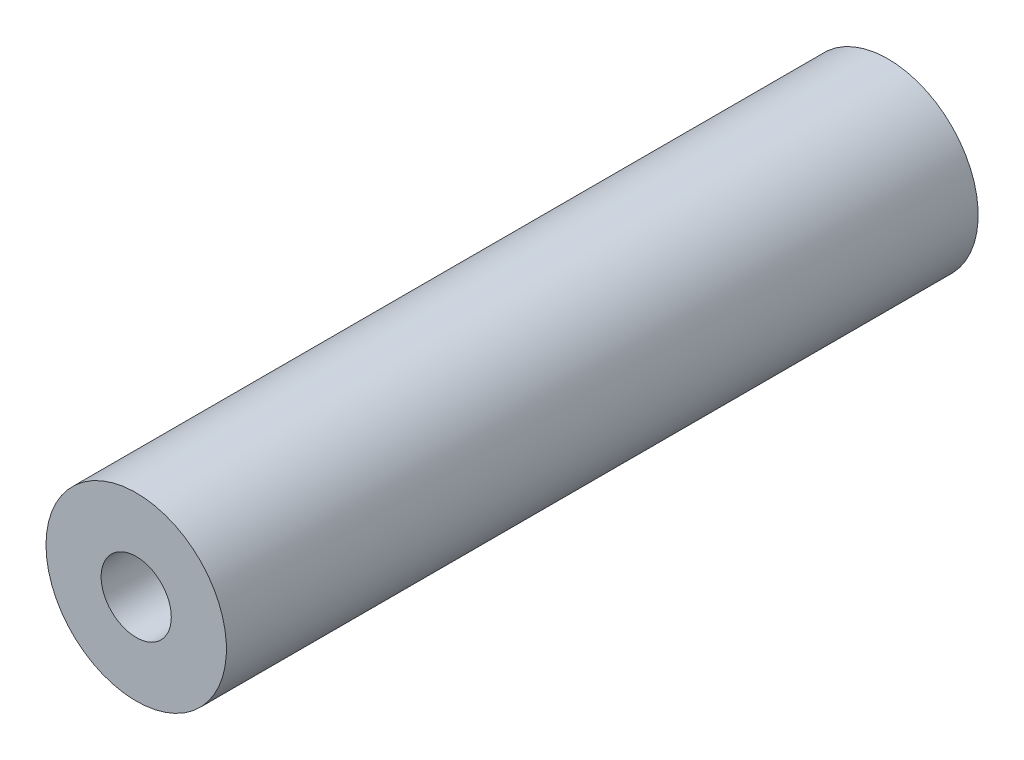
from build123d import *

# Parameters (mm, degrees)
ESBO_O1_R                = 5.4
RESSALTO_EXTRUS_O1_DEPTH = 45
PADR_OCIRCULAR1_COUNT    = 3


with BuildPart() as part:
    # Esbo_o1 → Ressalto-extrus_o1 (new body)
    with BuildSketch(Plane.XY):
        with Locations(Location((0, 0, 0), (0, 0, 180))):
            Circle(ESBO_O1_R)
    extrude(amount=RESSALTO_EXTRUS_O1_DEPTH)

    # Esbo_o2 → Furo roscado de M51 (revolve, cut)
    with BuildSketch(Plane(origin=(0, 0, 45), x_dir=(0, -1, 0), z_dir=(1, 0, 0))):
        Polygon((0, 0), (0, 15.2618073), (2.1, 14), (2.1, 0), align=None)
    revolve(axis=Axis((0, 0, 51.35), (0, 0, -1)), mode=Mode.SUBTRACT)

    # Esbo_o6 → Furo roscado de M21 (revolve, cut)
    with BuildSketch(Plane(origin=(0, 3, 0), x_dir=(0, 1, 0), z_dir=(1, 0, 0))):
        Polygon((0, 0), (0, 8.480688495), (0.8, 8), (0.8, 0), align=None)
    furo_roscado_de_m21 = revolve(axis=Axis((0, 3, -6.35), (0, 0, 1)), mode=Mode.SUBTRACT)

    # Padr_oCircular1: Furo roscado de M21 ×3 about axis
    padr_ocircular1_axis = Axis((0, 0, 0), (0, 0, 1))
    for i in range(1, PADR_OCIRCULAR1_COUNT):
        add(furo_roscado_de_m21.rotate(padr_ocircular1_axis, i * 360 / PADR_OCIRCULAR1_COUNT), mode=Mode.SUBTRACT)


solid = part.part
